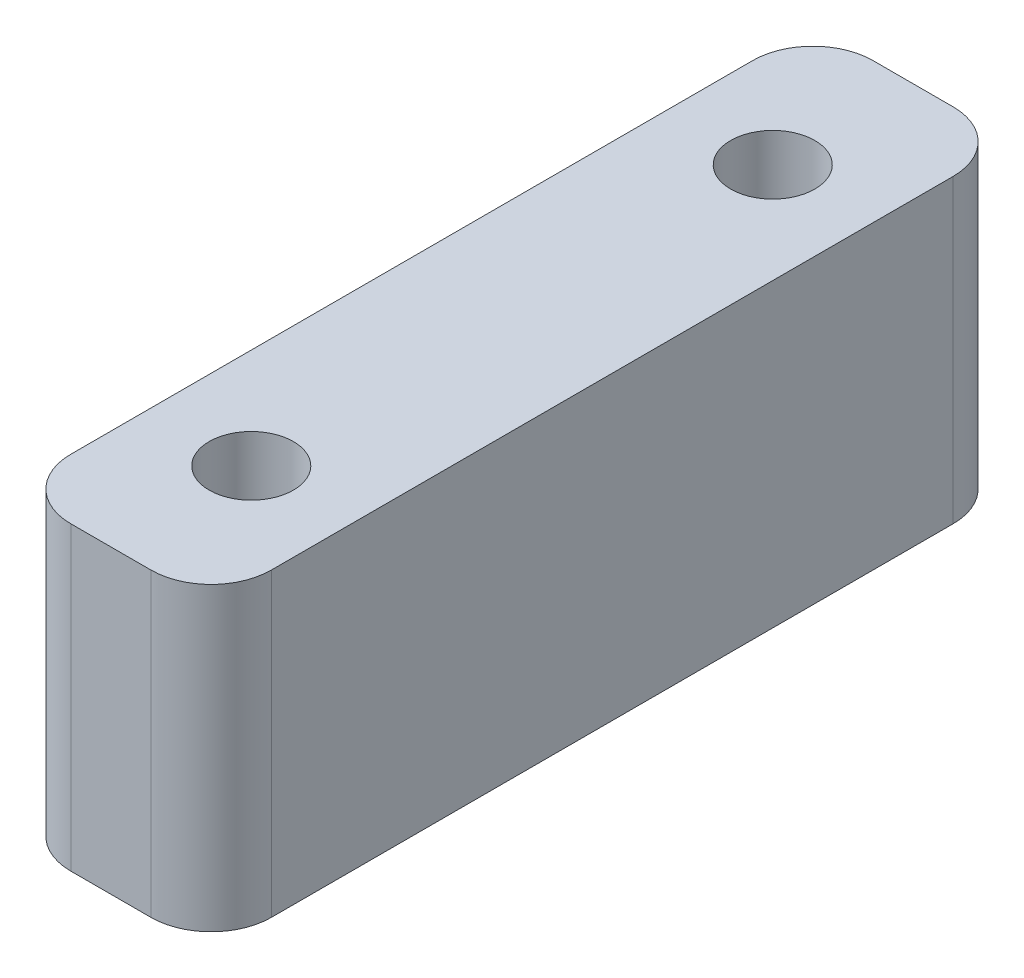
from build123d import *

# Parameters (mm, degrees)
SKETCH_1_W      = 10
SKETCH_1_H      = 40
SKETCH_1_R      = 2.1
EXTRUDE_1_DEPTH = 15
FILLET_1_R      = 3


with BuildPart() as part:
    # Sketch 1 → Extrude 1 (new body)
    with BuildSketch(Plane(origin=(0, 0, 0), x_dir=(1, 0, 0), z_dir=(0, 1, 0))):
        with Locations((-5, -20)):
            Rectangle(SKETCH_1_W, SKETCH_1_H)
        with Locations(Location((-5, -7, 0), (0, 0, 270))):
            Circle(SKETCH_1_R, mode=Mode.SUBTRACT)
        with Locations(Location((-5, -33, 0), (0, 0, 270))):
            Circle(SKETCH_1_R, mode=Mode.SUBTRACT)
    extrude(amount=EXTRUDE_1_DEPTH)

    # Fillet 1
    fillet_1_edges = [part.edges().sort_by_distance(p)[0] for p in [
        (-10, 7.5, 0),
        (0, 7.5, 0),
        (0, 7.5, 40),
        (-10, 7.5, 40),
    ]]
    fillet(fillet_1_edges, radius=FILLET_1_R)


solid = part.part
